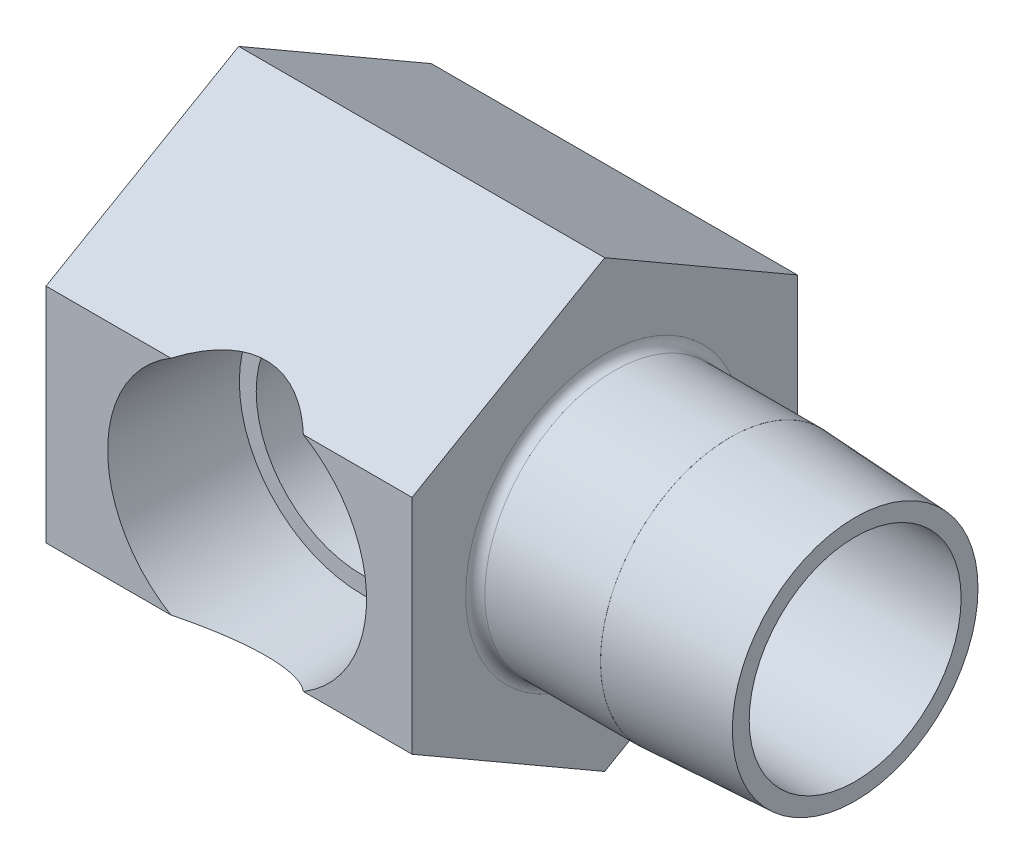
ISO-10303-21;
HEADER;
FILE_DESCRIPTION(('STEP AP214'),'2;1');
FILE_NAME('part.step','',(''),(''),'','','');
FILE_SCHEMA(('AUTOMOTIVE_DESIGN { 1 0 10303 214 1 1 1 1 }'));
ENDSEC;
DATA;
#1=APPLICATION_CONTEXT('core data for automotive mechanical design processes');
#2=APPLICATION_PROTOCOL_DEFINITION('international standard','automotive_design',2000,#1);
#3=PRODUCT_CONTEXT('',#1,'mechanical');
#4=PRODUCT('Part','Part','',(#3));
#5=PRODUCT_RELATED_PRODUCT_CATEGORY('part','',(#4));
#6=PRODUCT_DEFINITION_FORMATION('','',#4);
#7=PRODUCT_DEFINITION_CONTEXT('part definition',#1,'design');
#8=PRODUCT_DEFINITION('design','',#6,#7);
#9=PRODUCT_DEFINITION_SHAPE('','',#8);
#10=(LENGTH_UNIT() NAMED_UNIT(*) SI_UNIT(.MILLI.,.METRE.));
#11=(NAMED_UNIT(*) PLANE_ANGLE_UNIT() SI_UNIT($,.RADIAN.));
#12=(NAMED_UNIT(*) SI_UNIT($,.STERADIAN.) SOLID_ANGLE_UNIT());
#13=UNCERTAINTY_MEASURE_WITH_UNIT(LENGTH_MEASURE(1.E-05),#10,'distance_accuracy_value','');
#14=(GEOMETRIC_REPRESENTATION_CONTEXT(3) GLOBAL_UNCERTAINTY_ASSIGNED_CONTEXT((#13)) GLOBAL_UNIT_ASSIGNED_CONTEXT((#10,
#11,#12)) REPRESENTATION_CONTEXT('',''));
#15=CARTESIAN_POINT('',(0.,0.,0.));
#16=DIRECTION('',(0.,0.,1.));
#17=DIRECTION('',(1.,0.,0.));
#18=AXIS2_PLACEMENT_3D('',#15,#16,#17);
#19=CARTESIAN_POINT('',(10.3124,0.,0.));
#20=DIRECTION('',(-1.,0.,0.));
#21=DIRECTION('',(0.,0.,1.));
#22=AXIS2_PLACEMENT_3D('',#19,#20,#21);
#23=PLANE('',#22);
#24=CARTESIAN_POINT('',(10.3124,0.,0.));
#25=DIRECTION('',(-1.,0.,0.));
#26=DIRECTION('',(0.,0.,1.));
#27=AXIS2_PLACEMENT_3D('',#24,#25,#26);
#28=CIRCLE('',#27,8.73124999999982);
#29=CARTESIAN_POINT('',(10.3124,0.,8.73124999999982));
#30=VERTEX_POINT('',#29);
#31=EDGE_CURVE('E198',#30,#30,#28,.F.);
#32=ORIENTED_EDGE('',*,*,#31,.F.);
#33=EDGE_LOOP('',(#32));
#34=FACE_BOUND('',#33,.T.);
#35=CARTESIAN_POINT('',(10.3124,0.,0.));
#36=DIRECTION('',(-1.,0.,0.));
#37=DIRECTION('',(0.,0.,1.));
#38=AXIS2_PLACEMENT_3D('',#35,#36,#37);
#39=CIRCLE('',#38,10.1219);
#40=CARTESIAN_POINT('',(10.3124,0.,10.1219));
#41=VERTEX_POINT('',#40);
#42=EDGE_CURVE('E247',#41,#41,#39,.T.);
#43=ORIENTED_EDGE('',*,*,#42,.F.);
#44=EDGE_LOOP('',(#43));
#45=FACE_BOUND('',#44,.T.);
#46=ADVANCED_FACE('F14',(#34,#45),#23,.F.);
#47=CARTESIAN_POINT('',(23.0124,0.,0.));
#48=DIRECTION('',(-1.,0.,0.));
#49=DIRECTION('',(0.,0.,1.));
#50=AXIS2_PLACEMENT_3D('',#47,#48,#49);
#51=CYLINDRICAL_SURFACE('',#50,10.668);
#52=CARTESIAN_POINT('',(-9.5377,0.,0.));
#53=DIRECTION('',(1.,0.,0.));
#54=DIRECTION('',(0.,1.,0.));
#55=AXIS2_PLACEMENT_3D('',#52,#53,#54);
#56=CIRCLE('',#55,10.668);
#57=CARTESIAN_POINT('',(-9.5377,10.668,0.));
#58=VERTEX_POINT('',#57);
#59=EDGE_CURVE('E189',#58,#58,#56,.T.);
#60=ORIENTED_EDGE('',*,*,#59,.T.);
#61=EDGE_LOOP('',(#60));
#62=FACE_BOUND('',#61,.T.);
#63=CARTESIAN_POINT('',(0.,0.,0.));
#64=DIRECTION('',(1.,0.,0.));
#65=DIRECTION('',(0.,0.,-1.));
#66=AXIS2_PLACEMENT_3D('',#63,#64,#65);
#67=CIRCLE('',#66,10.668);
#68=CARTESIAN_POINT('',(0.,0.,-10.668));
#69=VERTEX_POINT('',#68);
#70=EDGE_CURVE('E17',#69,#69,#67,.F.);
#71=ORIENTED_EDGE('',*,*,#70,.T.);
#72=EDGE_LOOP('',(#71));
#73=FACE_BOUND('',#72,.T.);
#74=ADVANCED_FACE('F233',(#62,#73),#51,.T.);
#75=CARTESIAN_POINT('',(-10.3251,18.3308710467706,0.));
#76=DIRECTION('',(0.,-0.866025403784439,-0.5));
#77=DIRECTION('',(0.,0.5,-0.866025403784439));
#78=AXIS2_PLACEMENT_3D('',#75,#76,#77);
#79=PLANE('',#78);
#80=CARTESIAN_POINT('',(-24.7396,-1.05255916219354,33.5730859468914));
#81=DIRECTION('',(0.,-0.866025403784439,-0.5));
#82=DIRECTION('',(0.,-0.5,0.866025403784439));
#83=AXIS2_PLACEMENT_3D('',#80,#81,#82);
#84=ELLIPSE('',#83,23.191034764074,11.5476466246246);
#85=CARTESIAN_POINT('',(-19.2805693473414,9.16543552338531,15.875));
#86=VERTEX_POINT('',#85);
#87=CARTESIAN_POINT('',(-30.1986306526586,9.16543552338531,15.875));
#88=VERTEX_POINT('',#87);
#89=EDGE_CURVE('E133',#86,#88,#84,.F.);
#90=ORIENTED_EDGE('',*,*,#89,.F.);
#91=DIRECTION('',(-1.,0.,0.));
#92=VECTOR('',#91,1.);
#93=CARTESIAN_POINT('',(-10.3251,9.16543552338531,15.875));
#94=LINE('',#93,#92);
#95=CARTESIAN_POINT('',(-10.3251,9.16543552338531,15.875));
#96=VERTEX_POINT('',#95);
#97=EDGE_CURVE('E177',#96,#86,#94,.T.);
#98=ORIENTED_EDGE('',*,*,#97,.F.);
#99=DIRECTION('',(0.,-0.5,0.866025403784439));
#100=VECTOR('',#99,1.);
#101=CARTESIAN_POINT('',(-10.3251,18.3308710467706,0.));
#102=LINE('',#101,#100);
#103=CARTESIAN_POINT('',(-10.3251,18.3308710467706,0.));
#104=VERTEX_POINT('',#103);
#105=EDGE_CURVE('E161',#104,#96,#102,.T.);
#106=ORIENTED_EDGE('',*,*,#105,.F.);
#107=DIRECTION('',(-1.,0.,0.));
#108=VECTOR('',#107,1.);
#109=CARTESIAN_POINT('',(-10.3251,18.3308710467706,0.));
#110=LINE('',#109,#108);
#111=CARTESIAN_POINT('',(-40.4876,18.3308710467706,0.));
#112=VERTEX_POINT('',#111);
#113=EDGE_CURVE('E180',#104,#112,#110,.T.);
#114=ORIENTED_EDGE('',*,*,#113,.T.);
#115=DIRECTION('',(0.,-0.5,0.866025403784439));
#116=VECTOR('',#115,1.);
#117=CARTESIAN_POINT('',(-40.4876,18.3308710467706,0.));
#118=LINE('',#117,#116);
#119=CARTESIAN_POINT('',(-40.4876,9.16543552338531,15.875));
#120=VERTEX_POINT('',#119);
#121=EDGE_CURVE('E142',#112,#120,#118,.T.);
#122=ORIENTED_EDGE('',*,*,#121,.T.);
#123=EDGE_CURVE('E176',#88,#120,#94,.T.);
#124=ORIENTED_EDGE('',*,*,#123,.F.);
#125=EDGE_LOOP('',(#90,#98,#106,#114,#122,#124));
#126=FACE_BOUND('',#125,.T.);
#127=ADVANCED_FACE('F239',(#126),#79,.F.);
#128=CARTESIAN_POINT('',(-10.3251,9.16543552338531,15.875));
#129=DIRECTION('',(0.,0.,-1.));
#130=DIRECTION('',(-1.,0.,0.));
#131=AXIS2_PLACEMENT_3D('',#128,#129,#130);
#132=PLANE('',#131);
#133=CARTESIAN_POINT('',(-24.7396,0.,15.875));
#134=DIRECTION('',(0.,0.,-1.));
#135=DIRECTION('',(-1.,0.,0.));
#136=AXIS2_PLACEMENT_3D('',#133,#134,#135);
#137=CIRCLE('',#136,10.668);
#138=CARTESIAN_POINT('',(-19.2805693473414,-9.1654355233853,15.875));
#139=VERTEX_POINT('',#138);
#140=EDGE_CURVE('E131',#86,#139,#137,.T.);
#141=ORIENTED_EDGE('',*,*,#140,.T.);
#142=DIRECTION('',(-1.,0.,0.));
#143=VECTOR('',#142,1.);
#144=CARTESIAN_POINT('',(-10.3251,-9.1654355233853,15.875));
#145=LINE('',#144,#143);
#146=CARTESIAN_POINT('',(-10.3251,-9.1654355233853,15.875));
#147=VERTEX_POINT('',#146);
#148=EDGE_CURVE('E173',#147,#139,#145,.T.);
#149=ORIENTED_EDGE('',*,*,#148,.F.);
#150=DIRECTION('',(0.,-1.,0.));
#151=VECTOR('',#150,1.);
#152=CARTESIAN_POINT('',(-10.3251,9.16543552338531,15.875));
#153=LINE('',#152,#151);
#154=EDGE_CURVE('E163',#96,#147,#153,.T.);
#155=ORIENTED_EDGE('',*,*,#154,.F.);
#156=ORIENTED_EDGE('',*,*,#97,.T.);
#157=EDGE_LOOP('',(#141,#149,#155,#156));
#158=FACE_BOUND('',#157,.T.);
#159=ADVANCED_FACE('F284',(#158),#132,.F.);
#160=CARTESIAN_POINT('',(-30.1986306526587,-9.1654355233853,15.875));
#161=VERTEX_POINT('',#160);
#162=EDGE_CURVE('E37',#161,#88,#137,.T.);
#163=ORIENTED_EDGE('',*,*,#162,.T.);
#164=ORIENTED_EDGE('',*,*,#123,.T.);
#165=DIRECTION('',(0.,-1.,0.));
#166=VECTOR('',#165,1.);
#167=CARTESIAN_POINT('',(-40.4876,9.16543552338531,15.875));
#168=LINE('',#167,#166);
#169=CARTESIAN_POINT('',(-40.4876,-9.1654355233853,15.875));
#170=VERTEX_POINT('',#169);
#171=EDGE_CURVE('E146',#120,#170,#168,.T.);
#172=ORIENTED_EDGE('',*,*,#171,.T.);
#173=EDGE_CURVE('E172',#161,#170,#145,.T.);
#174=ORIENTED_EDGE('',*,*,#173,.F.);
#175=EDGE_LOOP('',(#163,#164,#172,#174));
#176=FACE_BOUND('',#175,.T.);
#177=ADVANCED_FACE('F279',(#176),#132,.F.);
#178=CARTESIAN_POINT('',(-10.3251,-9.1654355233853,15.875));
#179=DIRECTION('',(0.,0.866025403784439,-0.5));
#180=DIRECTION('',(0.,0.5,0.866025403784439));
#181=AXIS2_PLACEMENT_3D('',#178,#179,#180);
#182=PLANE('',#181);
#183=CARTESIAN_POINT('',(-24.7396,1.05255916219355,33.5730859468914));
#184=DIRECTION('',(0.,0.866025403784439,-0.5));
#185=DIRECTION('',(0.,0.5,0.866025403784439));
#186=AXIS2_PLACEMENT_3D('',#183,#184,#185);
#187=ELLIPSE('',#186,23.191034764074,11.5476466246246);
#188=EDGE_CURVE('E22',#161,#139,#187,.F.);
#189=ORIENTED_EDGE('',*,*,#188,.F.);
#190=ORIENTED_EDGE('',*,*,#173,.T.);
#191=DIRECTION('',(0.,-0.5,-0.866025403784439));
#192=VECTOR('',#191,1.);
#193=CARTESIAN_POINT('',(-40.4876,-9.1654355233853,15.875));
#194=LINE('',#193,#192);
#195=CARTESIAN_POINT('',(-40.4876,-18.3308710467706,0.));
#196=VERTEX_POINT('',#195);
#197=EDGE_CURVE('E150',#170,#196,#194,.T.);
#198=ORIENTED_EDGE('',*,*,#197,.T.);
#199=DIRECTION('',(-1.,0.,0.));
#200=VECTOR('',#199,1.);
#201=CARTESIAN_POINT('',(-10.3251,-18.3308710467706,0.));
#202=LINE('',#201,#200);
#203=CARTESIAN_POINT('',(-10.3251,-18.3308710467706,0.));
#204=VERTEX_POINT('',#203);
#205=EDGE_CURVE('E167',#204,#196,#202,.T.);
#206=ORIENTED_EDGE('',*,*,#205,.F.);
#207=DIRECTION('',(0.,-0.5,-0.866025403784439));
#208=VECTOR('',#207,1.);
#209=CARTESIAN_POINT('',(-10.3251,-9.1654355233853,15.875));
#210=LINE('',#209,#208);
#211=EDGE_CURVE('E165',#147,#204,#210,.T.);
#212=ORIENTED_EDGE('',*,*,#211,.F.);
#213=ORIENTED_EDGE('',*,*,#148,.T.);
#214=EDGE_LOOP('',(#189,#190,#198,#206,#212,#213));
#215=FACE_BOUND('',#214,.T.);
#216=ADVANCED_FACE('F283',(#215),#182,.F.);
#217=CARTESIAN_POINT('',(-10.3251,-18.3308710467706,0.));
#218=DIRECTION('',(0.,0.866025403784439,0.5));
#219=DIRECTION('',(0.,-0.5,0.866025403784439));
#220=AXIS2_PLACEMENT_3D('',#217,#218,#219);
#221=PLANE('',#220);
#222=DIRECTION('',(0.,0.5,-0.866025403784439));
#223=VECTOR('',#222,1.);
#224=CARTESIAN_POINT('',(-40.4876,-18.3308710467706,0.));
#225=LINE('',#224,#223);
#226=CARTESIAN_POINT('',(-40.4876,-9.16543552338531,-15.875));
#227=VERTEX_POINT('',#226);
#228=EDGE_CURVE('E135',#196,#227,#225,.T.);
#229=ORIENTED_EDGE('',*,*,#228,.T.);
#230=DIRECTION('',(-1.,0.,0.));
#231=VECTOR('',#230,1.);
#232=CARTESIAN_POINT('',(-10.3251,-9.16543552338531,-15.875));
#233=LINE('',#232,#231);
#234=CARTESIAN_POINT('',(-10.3251,-9.16543552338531,-15.875));
#235=VERTEX_POINT('',#234);
#236=EDGE_CURVE('E186',#235,#227,#233,.T.);
#237=ORIENTED_EDGE('',*,*,#236,.F.);
#238=DIRECTION('',(0.,0.5,-0.866025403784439));
#239=VECTOR('',#238,1.);
#240=CARTESIAN_POINT('',(-10.3251,-18.3308710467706,0.));
#241=LINE('',#240,#239);
#242=EDGE_CURVE('E153',#204,#235,#241,.T.);
#243=ORIENTED_EDGE('',*,*,#242,.F.);
#244=ORIENTED_EDGE('',*,*,#205,.T.);
#245=EDGE_LOOP('',(#229,#237,#243,#244));
#246=FACE_BOUND('',#245,.T.);
#247=ADVANCED_FACE('F303',(#246),#221,.F.);
#248=CARTESIAN_POINT('',(-10.3251,-9.16543552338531,-15.875));
#249=DIRECTION('',(0.,0.,1.));
#250=DIRECTION('',(0.,-1.,0.));
#251=AXIS2_PLACEMENT_3D('',#248,#249,#250);
#252=PLANE('',#251);
#253=DIRECTION('',(0.,1.,0.));
#254=VECTOR('',#253,1.);
#255=CARTESIAN_POINT('',(-40.4876,-9.16543552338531,-15.875));
#256=LINE('',#255,#254);
#257=CARTESIAN_POINT('',(-40.4876,9.16543552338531,-15.875));
#258=VERTEX_POINT('',#257);
#259=EDGE_CURVE('E136',#227,#258,#256,.T.);
#260=ORIENTED_EDGE('',*,*,#259,.T.);
#261=DIRECTION('',(-1.,0.,0.));
#262=VECTOR('',#261,1.);
#263=CARTESIAN_POINT('',(-10.3251,9.16543552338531,-15.875));
#264=LINE('',#263,#262);
#265=CARTESIAN_POINT('',(-10.3251,9.16543552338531,-15.875));
#266=VERTEX_POINT('',#265);
#267=EDGE_CURVE('E183',#266,#258,#264,.T.);
#268=ORIENTED_EDGE('',*,*,#267,.F.);
#269=DIRECTION('',(0.,1.,0.));
#270=VECTOR('',#269,1.);
#271=CARTESIAN_POINT('',(-10.3251,-9.16543552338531,-15.875));
#272=LINE('',#271,#270);
#273=EDGE_CURVE('E157',#235,#266,#272,.T.);
#274=ORIENTED_EDGE('',*,*,#273,.F.);
#275=ORIENTED_EDGE('',*,*,#236,.T.);
#276=EDGE_LOOP('',(#260,#268,#274,#275));
#277=FACE_BOUND('',#276,.T.);
#278=ADVANCED_FACE('F312',(#277),#252,.F.);
#279=CARTESIAN_POINT('',(-10.3251,9.16543552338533,-15.875));
#280=DIRECTION('',(0.,-0.86602540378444,0.5));
#281=DIRECTION('',(0.,-0.5,-0.86602540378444));
#282=AXIS2_PLACEMENT_3D('',#279,#280,#281);
#283=PLANE('',#282);
#284=DIRECTION('',(0.,0.5,0.86602540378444));
#285=VECTOR('',#284,1.);
#286=CARTESIAN_POINT('',(-40.4876,9.16543552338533,-15.875));
#287=LINE('',#286,#285);
#288=EDGE_CURVE('E139',#258,#112,#287,.T.);
#289=ORIENTED_EDGE('',*,*,#288,.T.);
#290=ORIENTED_EDGE('',*,*,#113,.F.);
#291=DIRECTION('',(0.,0.5,0.86602540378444));
#292=VECTOR('',#291,1.);
#293=CARTESIAN_POINT('',(-10.3251,9.16543552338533,-15.875));
#294=LINE('',#293,#292);
#295=EDGE_CURVE('E159',#266,#104,#294,.T.);
#296=ORIENTED_EDGE('',*,*,#295,.F.);
#297=ORIENTED_EDGE('',*,*,#267,.T.);
#298=EDGE_LOOP('',(#289,#290,#296,#297));
#299=FACE_BOUND('',#298,.T.);
#300=ADVANCED_FACE('F323',(#299),#283,.F.);
#301=CARTESIAN_POINT('',(-10.3251,-9.16543552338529,-15.875));
#302=DIRECTION('',(1.,0.,0.));
#303=DIRECTION('',(0.,1.,0.));
#304=AXIS2_PLACEMENT_3D('',#301,#302,#303);
#305=PLANE('',#304);
#306=CARTESIAN_POINT('',(-10.3251,0.,0.));
#307=DIRECTION('',(1.,0.,0.));
#308=DIRECTION('',(0.,1.,0.));
#309=AXIS2_PLACEMENT_3D('',#306,#307,#308);
#310=CIRCLE('',#309,11.4554);
#311=CARTESIAN_POINT('',(-10.3251,11.4554,0.));
#312=VERTEX_POINT('',#311);
#313=EDGE_CURVE('E192',#312,#312,#310,.F.);
#314=ORIENTED_EDGE('',*,*,#313,.T.);
#315=EDGE_LOOP('',(#314));
#316=FACE_BOUND('',#315,.T.);
#317=ORIENTED_EDGE('',*,*,#242,.T.);
#318=ORIENTED_EDGE('',*,*,#273,.T.);
#319=ORIENTED_EDGE('',*,*,#295,.T.);
#320=ORIENTED_EDGE('',*,*,#105,.T.);
#321=ORIENTED_EDGE('',*,*,#154,.T.);
#322=ORIENTED_EDGE('',*,*,#211,.T.);
#323=EDGE_LOOP('',(#317,#318,#319,#320,#321,#322));
#324=FACE_BOUND('',#323,.T.);
#325=ADVANCED_FACE('F332',(#316,#324),#305,.T.);
#326=CARTESIAN_POINT('',(-40.4876,-9.16543552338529,-15.875));
#327=DIRECTION('',(1.,0.,0.));
#328=DIRECTION('',(0.,1.,0.));
#329=AXIS2_PLACEMENT_3D('',#326,#327,#328);
#330=PLANE('',#329);
#331=ORIENTED_EDGE('',*,*,#228,.F.);
#332=ORIENTED_EDGE('',*,*,#197,.F.);
#333=ORIENTED_EDGE('',*,*,#171,.F.);
#334=ORIENTED_EDGE('',*,*,#121,.F.);
#335=ORIENTED_EDGE('',*,*,#288,.F.);
#336=ORIENTED_EDGE('',*,*,#259,.F.);
#337=EDGE_LOOP('',(#331,#332,#333,#334,#335,#336));
#338=FACE_BOUND('',#337,.T.);
#339=ADVANCED_FACE('F340',(#338),#330,.F.);
#340=CARTESIAN_POINT('',(-9.5377,0.,0.));
#341=DIRECTION('',(1.,0.,0.));
#342=DIRECTION('',(0.,1.,0.));
#343=AXIS2_PLACEMENT_3D('',#340,#341,#342);
#344=TOROIDAL_SURFACE('',#343,11.4554,0.7874);
#345=ORIENTED_EDGE('',*,*,#313,.F.);
#346=EDGE_LOOP('',(#345));
#347=FACE_BOUND('',#346,.T.);
#348=ORIENTED_EDGE('',*,*,#59,.F.);
#349=EDGE_LOOP('',(#348));
#350=FACE_BOUND('',#349,.T.);
#351=ADVANCED_FACE('F230',(#347,#350),#344,.F.);
#352=CARTESIAN_POINT('',(-24.7396,0.,15.875));
#353=DIRECTION('',(0.,0.,1.));
#354=DIRECTION('',(1.,0.,0.));
#355=AXIS2_PLACEMENT_3D('',#352,#353,#354);
#356=CONICAL_SURFACE('',#355,10.668,0.0523598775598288);
#357=CARTESIAN_POINT('',(-17.1717321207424,-6.73011387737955,5.5624));
#358=CARTESIAN_POINT('',(-17.0275717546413,-6.58213571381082,5.74139140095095));
#359=CARTESIAN_POINT('',(-16.8852115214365,-6.42627781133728,5.9154706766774));
#360=CARTESIAN_POINT('',(-16.6058645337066,-6.09837401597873,6.2530133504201));
#361=CARTESIAN_POINT('',(-16.4688864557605,-5.92630339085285,6.41645986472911));
#362=CARTESIAN_POINT('',(-16.2013558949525,-5.56440643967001,6.73277955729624));
#363=CARTESIAN_POINT('',(-16.0708711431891,-5.37443622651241,6.8855461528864));
#364=CARTESIAN_POINT('',(-15.8198832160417,-4.97815123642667,7.17727145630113));
#365=CARTESIAN_POINT('',(-15.6993738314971,-4.77184678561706,7.31623876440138));
#366=CARTESIAN_POINT('',(-15.4954339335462,-4.38969848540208,7.55009803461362));
#367=CARTESIAN_POINT('',(-15.4096327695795,-4.21696245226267,7.64800966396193));
#368=CARTESIAN_POINT('',(-15.2467159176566,-3.86199712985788,7.83324733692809));
#369=CARTESIAN_POINT('',(-15.1695981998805,-3.67977007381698,7.92057585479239));
#370=CARTESIAN_POINT('',(-15.0254329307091,-3.30686520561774,8.08335597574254));
#371=CARTESIAN_POINT('',(-14.958359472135,-3.11621083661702,8.15883815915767));
#372=CARTESIAN_POINT('',(-14.8352696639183,-2.72696762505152,8.29704746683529));
#373=CARTESIAN_POINT('',(-14.7792476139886,-2.52838293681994,8.3597811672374));
#374=CARTESIAN_POINT('',(-14.678850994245,-2.12236093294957,8.47201885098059));
#375=CARTESIAN_POINT('',(-14.6345976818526,-1.91485526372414,8.52138519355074));
#376=CARTESIAN_POINT('',(-14.5594905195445,-1.49442789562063,8.6050766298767));
#377=CARTESIAN_POINT('',(-14.5286368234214,-1.2815061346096,8.63940155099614));
#378=CARTESIAN_POINT('',(-14.4810952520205,-0.852126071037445,8.6922608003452));
#379=CARTESIAN_POINT('',(-14.4644079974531,-0.635667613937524,8.71079443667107));
#380=CARTESIAN_POINT('',(-14.4456434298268,-0.201352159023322,8.73163383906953));
#381=CARTESIAN_POINT('',(-14.4435641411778,0.0165046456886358,8.73394179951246));
#382=CARTESIAN_POINT('',(-14.4533416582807,0.421689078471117,8.72308449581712));
#383=CARTESIAN_POINT('',(-14.4633341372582,0.60912306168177,8.71198920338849));
#384=CARTESIAN_POINT('',(-14.4940403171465,0.982016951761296,8.67786932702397));
#385=CARTESIAN_POINT('',(-14.5147539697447,1.16747686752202,8.65484479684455));
#386=CARTESIAN_POINT('',(-14.5664900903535,1.53498981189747,8.5972733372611));
#387=CARTESIAN_POINT('',(-14.5975051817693,1.71704518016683,8.562734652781));
#388=CARTESIAN_POINT('',(-14.6692899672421,2.07675633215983,8.48267459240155));
#389=CARTESIAN_POINT('',(-14.7100600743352,2.25441192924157,8.43715275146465));
#390=CARTESIAN_POINT('',(-14.8007844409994,2.6047674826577,8.33566102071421));
#391=CARTESIAN_POINT('',(-14.8507593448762,2.77745527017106,8.27966764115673));
#392=CARTESIAN_POINT('',(-14.9590733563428,3.11671661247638,8.15802210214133));
#393=CARTESIAN_POINT('',(-15.0174154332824,3.28328797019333,8.09236651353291));
#394=CARTESIAN_POINT('',(-15.2041078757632,3.77365322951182,7.88167923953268));
#395=CARTESIAN_POINT('',(-15.3439507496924,4.08744436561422,7.72312033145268));
#396=CARTESIAN_POINT('',(-15.6140346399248,4.61896069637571,7.41435317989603));
#397=CARTESIAN_POINT('',(-15.7395970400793,4.84261456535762,7.27000880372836));
#398=CARTESIAN_POINT('',(-16.0025998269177,5.27158893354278,6.96522192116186));
#399=CARTESIAN_POINT('',(-16.14005173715,5.47689124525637,6.80476377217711));
#400=CARTESIAN_POINT('',(-16.4231511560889,5.86754844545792,6.47087544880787));
#401=CARTESIAN_POINT('',(-16.568740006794,6.05302358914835,6.29753573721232));
#402=CARTESIAN_POINT('',(-16.7918419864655,6.31733501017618,6.02841371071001));
#403=CARTESIAN_POINT('',(-16.8669232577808,6.40304815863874,5.93727721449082));
#404=CARTESIAN_POINT('',(-17.0184060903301,6.56995442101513,5.75203886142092));
#405=CARTESIAN_POINT('',(-17.0948074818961,6.65114811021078,5.65793738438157));
#406=CARTESIAN_POINT('',(-17.1717321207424,6.73011387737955,5.5624));
#407=B_SPLINE_CURVE_WITH_KNOTS('',3,(#357,#358,#359,#360,#361,#362,#363,#364,#365,#366,#367,
#368,#369,#370,#371,#372,#373,#374,#375,#376,#377,#378,#379,#380,#381,#382,#383,#384,#385,#386,
#387,#388,#389,#390,#391,#392,#393,#394,#395,#396,#397,#398,#399,#400,#401,#402,#403,#404,#405,
#406),.UNSPECIFIED.,.F.,.F.,(4,2,2,2,2,2,2,2,2,2,2,2,2,2,2,2,2,2,2,2,2,2,2,2,4),(0.,
0.820023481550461,1.64131879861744,2.46989520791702,3.29795193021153,3.94627694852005,
4.59445010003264,5.24092150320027,5.8870585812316,6.53961554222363,7.19217999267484,
7.84477303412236,8.49727781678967,9.06067705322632,9.6240737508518,10.187067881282,
10.7500858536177,11.3143822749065,11.8788794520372,13.0099648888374,13.8917191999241,
14.7743379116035,15.65125682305,16.0888974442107,16.5264822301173),.UNSPECIFIED.);
#408=CARTESIAN_POINT('',(-17.1715710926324,-6.72994857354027,5.5626));
#409=VERTEX_POINT('',#408);
#410=CARTESIAN_POINT('',(-17.1715710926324,6.72994857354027,5.5626));
#411=VERTEX_POINT('',#410);
#412=EDGE_CURVE('E116',#409,#411,#407,.T.);
#413=ORIENTED_EDGE('',*,*,#412,.F.);
#414=CARTESIAN_POINT('',(-24.7396,0.,5.5626));
#415=DIRECTION('',(0.,0.,-1.));
#416=DIRECTION('',(-1.,0.,0.));
#417=AXIS2_PLACEMENT_3D('',#414,#415,#416);
#418=CIRCLE('',#417,10.1275500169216);
#419=EDGE_CURVE('E118',#409,#411,#418,.T.);
#420=ORIENTED_EDGE('',*,*,#419,.T.);
#421=EDGE_LOOP('',(#413,#420));
#422=FACE_BOUND('',#421,.T.);
#423=ORIENTED_EDGE('',*,*,#89,.T.);
#424=ORIENTED_EDGE('',*,*,#162,.F.);
#425=ORIENTED_EDGE('',*,*,#188,.T.);
#426=ORIENTED_EDGE('',*,*,#140,.F.);
#427=EDGE_LOOP('',(#423,#424,#425,#426));
#428=FACE_BOUND('',#427,.T.);
#429=ADVANCED_FACE('F221',(#422,#428),#356,.F.);
#430=CARTESIAN_POINT('',(-14.6120499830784,0.,5.5626));
#431=DIRECTION('',(0.,0.,1.));
#432=DIRECTION('',(1.,0.,0.));
#433=AXIS2_PLACEMENT_3D('',#430,#431,#432);
#434=PLANE('',#433);
#435=DIRECTION('',(1.,0.,0.));
#436=VECTOR('',#435,1.);
#437=CARTESIAN_POINT('',(46.3279901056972,-6.72994857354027,5.5626));
#438=LINE('',#437,#436);
#439=CARTESIAN_POINT('',(-19.1670381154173,-6.72994857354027,5.5626));
#440=VERTEX_POINT('',#439);
#441=EDGE_CURVE('E120',#440,#409,#438,.T.);
#442=ORIENTED_EDGE('',*,*,#441,.F.);
#443=CARTESIAN_POINT('',(-24.7396,0.,5.5626));
#444=DIRECTION('',(0.,0.,-1.));
#445=DIRECTION('',(-1.,0.,0.));
#446=AXIS2_PLACEMENT_3D('',#443,#444,#445);
#447=CIRCLE('',#446,8.7376);
#448=CARTESIAN_POINT('',(-19.1670381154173,6.72994857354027,5.5626));
#449=VERTEX_POINT('',#448);
#450=EDGE_CURVE('E111',#440,#449,#447,.T.);
#451=ORIENTED_EDGE('',*,*,#450,.T.);
#452=DIRECTION('',(1.,0.,0.));
#453=VECTOR('',#452,1.);
#454=CARTESIAN_POINT('',(46.3279901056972,6.72994857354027,5.5626));
#455=LINE('',#454,#453);
#456=EDGE_CURVE('E112',#411,#449,#455,.F.);
#457=ORIENTED_EDGE('',*,*,#456,.F.);
#458=ORIENTED_EDGE('',*,*,#419,.F.);
#459=EDGE_LOOP('',(#442,#451,#457,#458));
#460=FACE_BOUND('',#459,.T.);
#461=ADVANCED_FACE('F222',(#460),#434,.T.);
#462=CARTESIAN_POINT('',(-24.7396,0.,27.2225954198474));
#463=DIRECTION('',(0.,0.,-1.));
#464=DIRECTION('',(-1.,0.,0.));
#465=AXIS2_PLACEMENT_3D('',#462,#463,#464);
#466=CYLINDRICAL_SURFACE('',#465,8.7376);
#467=CARTESIAN_POINT('',(-16.002,0.,-8.73124999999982));
#468=CARTESIAN_POINT('',(-16.0020020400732,-0.194584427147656,-8.73124795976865));
#469=CARTESIAN_POINT('',(-16.0085144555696,-0.389211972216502,-8.72473081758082));
#470=CARTESIAN_POINT('',(-16.0344312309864,-0.776828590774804,-8.69879510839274));
#471=CARTESIAN_POINT('',(-16.0538433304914,-0.969816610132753,-8.67936879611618));
#472=CARTESIAN_POINT('',(-16.1051919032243,-1.35279132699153,-8.62798220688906));
#473=CARTESIAN_POINT('',(-16.1371515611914,-1.54277178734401,-8.59599872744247));
#474=CARTESIAN_POINT('',(-16.2129602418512,-1.91800162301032,-8.5201326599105));
#475=CARTESIAN_POINT('',(-16.256815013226,-2.10324866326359,-8.47624431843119));
#476=CARTESIAN_POINT('',(-16.3552007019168,-2.46629304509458,-8.37778181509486));
#477=CARTESIAN_POINT('',(-16.4096455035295,-2.64413729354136,-8.32329384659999));
#478=CARTESIAN_POINT('',(-16.5285521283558,-2.99304779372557,-8.2042906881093));
#479=CARTESIAN_POINT('',(-16.5930177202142,-3.16411146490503,-8.13977172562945));
#480=CARTESIAN_POINT('',(-16.7309899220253,-3.49864884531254,-8.00168209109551));
#481=CARTESIAN_POINT('',(-16.8044923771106,-3.66212599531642,-7.92811557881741));
#482=CARTESIAN_POINT('',(-16.9596542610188,-3.98115293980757,-7.77281411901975));
#483=CARTESIAN_POINT('',(-17.0413155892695,-4.13670087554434,-7.69107726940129));
#484=CARTESIAN_POINT('',(-17.2468436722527,-4.50158308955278,-7.48535222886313));
#485=CARTESIAN_POINT('',(-17.3743057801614,-4.7068770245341,-7.35776254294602));
#486=CARTESIAN_POINT('',(-17.64142348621,-5.10080513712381,-7.09036110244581));
#487=CARTESIAN_POINT('',(-17.7810802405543,-5.28943773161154,-6.95054818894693));
#488=CARTESIAN_POINT('',(-18.0709842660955,-5.65057111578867,-6.66029722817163));
#489=CARTESIAN_POINT('',(-18.2212555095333,-5.82303320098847,-6.50983512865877));
#490=CARTESIAN_POINT('',(-18.5304028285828,-6.15161912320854,-6.20026353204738));
#491=CARTESIAN_POINT('',(-18.6892789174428,-6.30774293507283,-6.04115402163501));
#492=CARTESIAN_POINT('',(-19.077133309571,-6.66146937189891,-5.65267776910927));
#493=CARTESIAN_POINT('',(-19.3094480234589,-6.85174414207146,-5.41994958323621));
#494=CARTESIAN_POINT('',(-19.7848472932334,-7.20301910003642,-4.94356992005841));
#495=CARTESIAN_POINT('',(-20.0279369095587,-7.36400534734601,-4.69991330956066));
#496=CARTESIAN_POINT('',(-20.5220085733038,-7.65767994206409,-4.20446075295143));
#497=CARTESIAN_POINT('',(-20.7729811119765,-7.79040098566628,-3.95267460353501));
#498=CARTESIAN_POINT('',(-21.2809025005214,-8.0288054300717,-3.44270332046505));
#499=CARTESIAN_POINT('',(-21.5378485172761,-8.13450137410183,-3.18452121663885));
#500=CARTESIAN_POINT('',(-21.951750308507,-8.28254836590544,-2.76793783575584));
#501=CARTESIAN_POINT('',(-22.1073855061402,-8.3332845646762,-2.61114099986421));
#502=CARTESIAN_POINT('',(-22.4197776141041,-8.42559206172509,-2.29589073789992));
#503=CARTESIAN_POINT('',(-22.5765347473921,-8.46716148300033,-2.13743697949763));
#504=CARTESIAN_POINT('',(-22.8566044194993,-8.53322740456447,-1.85341979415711));
#505=CARTESIAN_POINT('',(-22.9798151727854,-8.5594718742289,-1.72815748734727));
#506=CARTESIAN_POINT('',(-23.2257977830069,-8.60637337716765,-1.47694205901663));
#507=CARTESIAN_POINT('',(-23.3485697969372,-8.62704779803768,-1.35099236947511));
#508=CARTESIAN_POINT('',(-23.5518174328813,-8.65687758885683,-1.1403356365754));
#509=CARTESIAN_POINT('',(-23.6325518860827,-8.66756378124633,-1.05608985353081));
#510=CARTESIAN_POINT('',(-23.7938983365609,-8.68665280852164,-0.885577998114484));
#511=CARTESIAN_POINT('',(-23.8745009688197,-8.6950316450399,-0.799300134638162));
#512=CARTESIAN_POINT('',(-23.9939135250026,-8.70581636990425,-0.667427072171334));
#513=CARTESIAN_POINT('',(-24.033702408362,-8.70912835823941,-0.622785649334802));
#514=CARTESIAN_POINT('',(-24.1122485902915,-8.71513811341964,-0.532136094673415));
#515=CARTESIAN_POINT('',(-24.150999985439,-8.71783283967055,-0.486122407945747));
#516=CARTESIAN_POINT('',(-24.2252154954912,-8.72252382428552,-0.393005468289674));
#517=CARTESIAN_POINT('',(-24.2607284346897,-8.72453249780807,-0.345940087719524));
#518=CARTESIAN_POINT('',(-24.3260105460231,-8.72786360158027,-0.248009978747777));
#519=CARTESIAN_POINT('',(-24.3558375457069,-8.72919320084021,-0.197191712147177));
#520=CARTESIAN_POINT('',(-24.381573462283,-8.73026315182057,-0.131726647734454));
#521=CARTESIAN_POINT('',(-24.3855934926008,-8.73042652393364,-0.120449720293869));
#522=CARTESIAN_POINT('',(-24.3927089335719,-8.73071197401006,-0.097606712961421));
#523=CARTESIAN_POINT('',(-24.3958040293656,-8.73083403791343,-0.0860405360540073));
#524=CARTESIAN_POINT('',(-24.4033826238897,-8.7311305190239,-0.0511699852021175));
#525=CARTESIAN_POINT('',(-24.4062538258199,-8.7312389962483,-0.0274712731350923));
#526=CARTESIAN_POINT('',(-24.406791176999,-8.73125946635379,0.0201415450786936));
#527=CARTESIAN_POINT('',(-24.4044222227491,-8.73117013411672,0.0440560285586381));
#528=CARTESIAN_POINT('',(-24.3950886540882,-8.73080677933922,0.0911053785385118));
#529=CARTESIAN_POINT('',(-24.3880850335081,-8.73053118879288,0.114231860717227));
#530=CARTESIAN_POINT('',(-24.3613715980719,-8.72942751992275,0.184805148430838));
#531=CARTESIAN_POINT('',(-24.336262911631,-8.7283274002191,0.230059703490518));
#532=CARTESIAN_POINT('',(-24.2808399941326,-8.72559491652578,0.317207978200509));
#533=CARTESIAN_POINT('',(-24.2504888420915,-8.72395869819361,0.359074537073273));
#534=CARTESIAN_POINT('',(-24.1481965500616,-8.71784635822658,0.49241666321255));
#535=CARTESIAN_POINT('',(-24.0717549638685,-8.71237926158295,0.580385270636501));
#536=CARTESIAN_POINT('',(-23.9162306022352,-8.69907947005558,0.75378513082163));
#537=CARTESIAN_POINT('',(-23.8371433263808,-8.69124254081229,0.839211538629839));
#538=CARTESIAN_POINT('',(-23.6779684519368,-8.67323190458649,1.00847172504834));
#539=CARTESIAN_POINT('',(-23.5978843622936,-8.66306494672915,1.09230936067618));
#540=CARTESIAN_POINT('',(-23.4373250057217,-8.64038918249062,1.25915432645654));
#541=CARTESIAN_POINT('',(-23.3568500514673,-8.62788201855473,1.34216219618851));
#542=CARTESIAN_POINT('',(-23.1168171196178,-8.58710464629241,1.58869321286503));
#543=CARTESIAN_POINT('',(-22.9570155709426,-8.5553951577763,1.75143229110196));
#544=CARTESIAN_POINT('',(-22.6379021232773,-8.48264950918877,2.07530786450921));
#545=CARTESIAN_POINT('',(-22.4785902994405,-8.44161198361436,2.23644412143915));
#546=CARTESIAN_POINT('',(-22.0019471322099,-8.30423407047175,2.71769566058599));
#547=CARTESIAN_POINT('',(-21.6861412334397,-8.1936672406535,3.03541666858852));
#548=CARTESIAN_POINT('',(-21.0620025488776,-7.93318916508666,3.6625986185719));
#549=CARTESIAN_POINT('',(-20.7536771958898,-7.78324040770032,3.97205137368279));
#550=CARTESIAN_POINT('',(-20.1484858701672,-7.44229907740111,4.57908034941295));
#551=CARTESIAN_POINT('',(-19.8516106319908,-7.25134054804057,4.87666617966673));
#552=CARTESIAN_POINT('',(-19.3875780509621,-6.910044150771,5.34165989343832));
#553=CARTESIAN_POINT('',(-19.2154110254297,-6.7733595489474,5.51414839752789));
#554=CARTESIAN_POINT('',(-18.8780954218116,-6.48366113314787,5.85204308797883));
#555=CARTESIAN_POINT('',(-18.7129463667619,-6.33064843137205,6.01744975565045));
#556=CARTESIAN_POINT('',(-18.2305672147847,-5.84682072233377,6.50052935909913));
#557=CARTESIAN_POINT('',(-17.9255519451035,-5.49060305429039,6.80591666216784));
#558=CARTESIAN_POINT('',(-17.417683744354,-4.78392446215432,7.31434488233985));
#559=CARTESIAN_POINT('',(-17.2064743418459,-4.44561570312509,7.52576393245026));
#560=CARTESIAN_POINT('',(-16.9207757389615,-3.90553017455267,7.8117285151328));
#561=CARTESIAN_POINT('',(-16.8307332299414,-3.72007663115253,7.90185159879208));
#562=CARTESIAN_POINT('',(-16.6623661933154,-3.33876204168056,8.07036499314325));
#563=CARTESIAN_POINT('',(-16.5840394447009,-3.14290297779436,8.14875752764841));
#564=CARTESIAN_POINT('',(-16.4533259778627,-2.77741093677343,8.27957822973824));
#565=CARTESIAN_POINT('',(-16.3988030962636,-2.60930304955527,8.33414480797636));
#566=CARTESIAN_POINT('',(-16.2994595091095,-2.26745357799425,8.43356675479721));
#567=CARTESIAN_POINT('',(-16.254636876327,-2.0937131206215,8.4784240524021));
#568=CARTESIAN_POINT('',(-16.1754298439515,-1.74160557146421,8.55769160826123));
#569=CARTESIAN_POINT('',(-16.1410407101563,-1.5632406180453,8.59210660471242));
#570=CARTESIAN_POINT('',(-16.0832828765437,-1.20295803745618,8.6499075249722));
#571=CARTESIAN_POINT('',(-16.059914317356,-1.02104036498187,8.67329330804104));
#572=CARTESIAN_POINT('',(-16.024576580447,-0.654283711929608,8.70865698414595));
#573=CARTESIAN_POINT('',(-16.0126513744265,-0.46943621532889,8.72059087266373));
#574=CARTESIAN_POINT('',(-16.0005951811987,-0.0989697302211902,8.73265584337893));
#575=CARTESIAN_POINT('',(-16.0004642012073,0.0866492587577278,8.7327869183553));
#576=CARTESIAN_POINT('',(-16.0119990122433,0.457153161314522,8.72124371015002));
#577=CARTESIAN_POINT('',(-16.0236651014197,0.642038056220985,8.70956912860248));
#578=CARTESIAN_POINT('',(-16.0585609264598,1.00960102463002,8.67464769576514));
#579=CARTESIAN_POINT('',(-16.0817904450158,1.19227913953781,8.65140106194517));
#580=CARTESIAN_POINT('',(-16.1376962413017,1.5435978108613,8.59545357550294));
#581=CARTESIAN_POINT('',(-16.1697477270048,1.71243875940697,8.56337800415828));
#582=CARTESIAN_POINT('',(-16.2432172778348,2.04605005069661,8.48985242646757));
#583=CARTESIAN_POINT('',(-16.2846388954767,2.21081882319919,8.44839886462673));
#584=CARTESIAN_POINT('',(-16.3762362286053,2.53539687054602,8.35672960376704));
#585=CARTESIAN_POINT('',(-16.4264119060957,2.69520616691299,8.3065139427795));
#586=CARTESIAN_POINT('',(-16.5348605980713,3.0092382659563,8.19797696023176));
#587=CARTESIAN_POINT('',(-16.5931352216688,3.16345995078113,8.13965402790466));
#588=CARTESIAN_POINT('',(-16.7397423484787,3.52103226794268,7.99292233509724));
#589=CARTESIAN_POINT('',(-16.8312810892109,3.72176242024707,7.90130357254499));
#590=CARTESIAN_POINT('',(-17.0264734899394,4.11105686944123,7.70593347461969));
#591=CARTESIAN_POINT('',(-17.1301306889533,4.2996175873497,7.6021785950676));
#592=CARTESIAN_POINT('',(-17.3480971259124,4.66439092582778,7.38399695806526));
#593=CARTESIAN_POINT('',(-17.4624211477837,4.84058579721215,7.26955538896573));
#594=CARTESIAN_POINT('',(-17.7001339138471,5.18020722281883,7.03158489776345));
#595=CARTESIAN_POINT('',(-17.8235230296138,5.34363325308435,6.90805560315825));
#596=CARTESIAN_POINT('',(-18.1251066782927,5.71583582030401,6.60610841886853));
#597=CARTESIAN_POINT('',(-18.3067164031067,5.91907945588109,6.42426373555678));
#598=CARTESIAN_POINT('',(-18.6817462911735,6.30238103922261,6.0486994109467));
#599=CARTESIAN_POINT('',(-18.8751707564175,6.48243046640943,5.85497544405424));
#600=CARTESIAN_POINT('',(-19.2718799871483,6.8203891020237,5.45757943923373));
#601=CARTESIAN_POINT('',(-19.4751828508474,6.97825543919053,5.25388913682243));
#602=CARTESIAN_POINT('',(-19.8893619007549,7.27223101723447,4.83880832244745));
#603=CARTESIAN_POINT('',(-20.1002376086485,7.40834162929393,4.6274182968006));
#604=CARTESIAN_POINT('',(-20.602950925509,7.70363293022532,4.12327947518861));
#605=CARTESIAN_POINT('',(-20.89729486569,7.85421669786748,3.82794844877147));
#606=CARTESIAN_POINT('',(-21.3445677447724,8.05270383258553,3.37868435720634));
#607=CARTESIAN_POINT('',(-21.4946883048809,8.11432340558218,3.22781450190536));
#608=CARTESIAN_POINT('',(-21.7964934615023,8.2285969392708,2.92424701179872));
#609=CARTESIAN_POINT('',(-21.9481779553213,8.28125148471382,2.77154949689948));
#610=CARTESIAN_POINT('',(-22.2523738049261,8.37763466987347,2.46490144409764));
#611=CARTESIAN_POINT('',(-22.4048825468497,8.42138304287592,2.31095447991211));
#612=CARTESIAN_POINT('',(-22.7106688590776,8.5002358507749,2.00155294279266));
#613=CARTESIAN_POINT('',(-22.8639465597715,8.53533876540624,1.84609810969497));
#614=CARTESIAN_POINT('',(-23.1703819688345,8.59695458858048,1.53375849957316));
#615=CARTESIAN_POINT('',(-23.323539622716,8.62347694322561,1.37687549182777));
#616=CARTESIAN_POINT('',(-23.6286430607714,8.66804695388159,1.060768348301));
#617=CARTESIAN_POINT('',(-23.7805894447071,8.68609909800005,0.901545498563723));
#618=CARTESIAN_POINT('',(-24.02409592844,8.70877341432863,0.634873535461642));
#619=CARTESIAN_POINT('',(-24.1176991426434,8.71589085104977,0.529425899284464));
#620=CARTESIAN_POINT('',(-24.2552735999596,8.72430499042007,0.35410855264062));
#621=CARTESIAN_POINT('',(-24.3034456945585,8.72679002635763,0.288138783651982));
#622=CARTESIAN_POINT('',(-24.3541031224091,8.729101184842,0.194881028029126));
#623=CARTESIAN_POINT('',(-24.3650948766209,8.72957575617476,0.172518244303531));
#624=CARTESIAN_POINT('',(-24.3839468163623,8.73036364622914,0.126517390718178));
#625=CARTESIAN_POINT('',(-24.3918167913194,8.73067746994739,0.102883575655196));
#626=CARTESIAN_POINT('',(-24.4017747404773,8.73106804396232,0.05952342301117));
#627=CARTESIAN_POINT('',(-24.4047237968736,8.73118048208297,0.0400042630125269));
#628=CARTESIAN_POINT('',(-24.4071151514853,8.73127193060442,0.000763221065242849));
#629=CARTESIAN_POINT('',(-24.4065621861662,8.73125112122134,-0.018958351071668));
#630=CARTESIAN_POINT('',(-24.402103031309,8.73107971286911,-0.0579056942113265));
#631=CARTESIAN_POINT('',(-24.3982115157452,8.7309296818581,-0.077133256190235));
#632=CARTESIAN_POINT('',(-24.3877566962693,8.73051484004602,-0.114860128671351));
#633=CARTESIAN_POINT('',(-24.3811873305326,8.73024976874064,-0.133357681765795));
#634=CARTESIAN_POINT('',(-24.3511300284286,8.72898749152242,-0.206233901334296));
#635=CARTESIAN_POINT('',(-24.320324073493,8.72759479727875,-0.257405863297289));
#636=CARTESIAN_POINT('',(-24.2532518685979,8.72412321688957,-0.356144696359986));
#637=CARTESIAN_POINT('',(-24.2169308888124,8.72203717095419,-0.40366729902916));
#638=CARTESIAN_POINT('',(-24.0932190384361,8.71408023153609,-0.557845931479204));
#639=CARTESIAN_POINT('',(-24.0010810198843,8.70682435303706,-0.660674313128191));
#640=CARTESIAN_POINT('',(-23.8144213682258,8.68900060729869,-0.863851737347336));
#641=CARTESIAN_POINT('',(-23.7198961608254,8.67842746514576,-0.964196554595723));
#642=CARTESIAN_POINT('',(-23.5302099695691,8.65402061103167,-1.16304341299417));
#643=CARTESIAN_POINT('',(-23.4350541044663,8.64020255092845,-1.2615519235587));
#644=CARTESIAN_POINT('',(-23.2445085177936,8.60927992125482,-1.45768707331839));
#645=CARTESIAN_POINT('',(-23.1491189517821,8.59217714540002,-1.55531416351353));
#646=CARTESIAN_POINT('',(-22.7416135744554,8.51203730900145,-1.97110883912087));
#647=CARTESIAN_POINT('',(-22.4295012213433,8.43292269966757,-2.28638870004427));
#648=CARTESIAN_POINT('',(-21.8099951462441,8.23825366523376,-2.91080137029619));
#649=CARTESIAN_POINT('',(-21.5026058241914,8.1226671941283,-3.21992851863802));
#650=CARTESIAN_POINT('',(-20.8952779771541,7.85348929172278,-3.82998854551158));
#651=CARTESIAN_POINT('',(-20.5953517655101,7.69983911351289,-4.13090795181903));
#652=CARTESIAN_POINT('',(-20.0071166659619,7.35294307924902,-4.72079553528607));
#653=CARTESIAN_POINT('',(-19.7187988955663,7.15972821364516,-5.00977285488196));
#654=CARTESIAN_POINT('',(-19.2669219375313,6.81483228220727,-5.46254493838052));
#655=CARTESIAN_POINT('',(-19.0984059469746,6.67617271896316,-5.63136167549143));
#656=CARTESIAN_POINT('',(-18.7685104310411,6.38282740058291,-5.96180105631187));
#657=CARTESIAN_POINT('',(-18.6071304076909,6.22814276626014,-6.12342420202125));
#658=CARTESIAN_POINT('',(-18.1362689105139,5.73984762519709,-6.59494764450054));
#659=CARTESIAN_POINT('',(-17.8391751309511,5.38133142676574,-6.8923944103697));
#660=CARTESIAN_POINT('',(-17.346107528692,4.67228730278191,-7.38599386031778));
#661=CARTESIAN_POINT('',(-17.1416907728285,4.33363653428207,-7.5906099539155));
#662=CARTESIAN_POINT('',(-16.86614207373,3.79409663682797,-7.86641137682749));
#663=CARTESIAN_POINT('',(-16.7794608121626,3.60895802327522,-7.95316917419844));
#664=CARTESIAN_POINT('',(-16.6177879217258,3.2286920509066,-8.11498092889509));
#665=CARTESIAN_POINT('',(-16.5427937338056,3.03356689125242,-8.19003744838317));
#666=CARTESIAN_POINT('',(-16.4178808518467,2.66926471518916,-8.31505186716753));
#667=CARTESIAN_POINT('',(-16.3658705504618,2.50151910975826,-8.36710351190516));
#668=CARTESIAN_POINT('',(-16.2715206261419,2.16067893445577,-8.46152731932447));
#669=CARTESIAN_POINT('',(-16.2291790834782,1.98758543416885,-8.50390140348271));
#670=CARTESIAN_POINT('',(-16.1549250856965,1.63737162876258,-8.57821183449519));
#671=CARTESIAN_POINT('',(-16.1229905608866,1.46026070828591,-8.61017026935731));
#672=CARTESIAN_POINT('',(-16.0700022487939,1.10287331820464,-8.66319796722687));
#673=CARTESIAN_POINT('',(-16.0489430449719,0.922598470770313,-8.6842726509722));
#674=CARTESIAN_POINT('',(-16.0230379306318,0.61842168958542,-8.71019674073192));
#675=CARTESIAN_POINT('',(-16.015156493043,0.495022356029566,-8.71808392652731));
#676=CARTESIAN_POINT('',(-16.00463637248,0.247754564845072,-8.72861171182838));
#677=CARTESIAN_POINT('',(-16.0019987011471,0.123886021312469,-8.73125129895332));
#678=CARTESIAN_POINT('',(-16.002,0.,-8.73124999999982));
#679=B_SPLINE_CURVE_WITH_KNOTS('',3,(#467,#468,#469,#470,#471,#472,#473,#474,#475,#476,#477,
#478,#479,#480,#481,#482,#483,#484,#485,#486,#487,#488,#489,#490,#491,#492,#493,#494,#495,#496,
#497,#498,#499,#500,#501,#502,#503,#504,#505,#506,#507,#508,#509,#510,#511,#512,#513,#514,#515,
#516,#517,#518,#519,#520,#521,#522,#523,#524,#525,#526,#527,#528,#529,#530,#531,#532,#533,#534,
#535,#536,#537,#538,#539,#540,#541,#542,#543,#544,#545,#546,#547,#548,#549,#550,#551,#552,#553,
#554,#555,#556,#557,#558,#559,#560,#561,#562,#563,#564,#565,#566,#567,#568,#569,#570,#571,#572,
#573,#574,#575,#576,#577,#578,#579,#580,#581,#582,#583,#584,#585,#586,#587,#588,#589,#590,#591,
#592,#593,#594,#595,#596,#597,#598,#599,#600,#601,#602,#603,#604,#605,#606,#607,#608,#609,#610,
#611,#612,#613,#614,#615,#616,#617,#618,#619,#620,#621,#622,#623,#624,#625,#626,#627,#628,#629,
#630,#631,#632,#633,#634,#635,#636,#637,#638,#639,#640,#641,#642,#643,#644,#645,#646,#647,#648,
#649,#650,#651,#652,#653,#654,#655,#656,#657,#658,#659,#660,#661,#662,#663,#664,#665,#666,#667,
#668,#669,#670,#671,#672,#673,#674,#675,#676,#677,#678),.UNSPECIFIED.,.T.,.F.,(4,2,2,2,2,2,2,2,
2,2,2,2,2,2,2,2,2,2,2,2,2,2,2,2,2,2,2,2,2,2,2,2,2,2,2,2,2,2,2,2,2,2,2,2,2,2,2,2,2,2,2,2,2,2,2,2,
2,2,2,2,2,2,2,2,2,2,2,2,2,2,2,2,2,2,2,2,2,2,2,2,2,2,2,2,2,2,2,2,2,2,2,2,2,2,2,2,2,2,2,2,2,2,2,2,
2,4),(0.,0.583612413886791,1.16757530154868,1.75262232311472,2.3379525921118,2.91870833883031,
3.49968302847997,4.08039159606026,4.66123567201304,5.47979311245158,6.29842824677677,
7.11897529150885,7.93952359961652,9.07759978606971,10.2162162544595,11.3535083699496,
12.4902716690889,13.1701291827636,13.85012577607,14.3830023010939,14.9141955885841,
15.2656970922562,15.62072714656,15.8004033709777,15.9809464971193,16.1580238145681,
16.3331909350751,16.3690696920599,16.4049606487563,16.4760278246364,16.5475725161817,
16.61972713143,16.7737867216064,16.9289791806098,17.2784485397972,17.6285460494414,
17.9776420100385,18.3264938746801,19.0170858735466,19.7077790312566,21.0901665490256,
22.4738756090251,23.856440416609,24.6940964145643,25.5316953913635,27.2028655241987,
28.5515700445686,29.225841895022,29.8999857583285,30.4543223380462,31.0085486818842,
31.5625231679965,32.1165047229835,32.67260655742,33.2287087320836,33.7848249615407,
34.3409307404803,34.8648402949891,35.3889488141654,35.9130550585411,36.4372655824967,
37.1528654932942,37.8686749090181,38.5854915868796,39.3023376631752,40.2838426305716,
41.2657071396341,42.2494438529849,43.2331185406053,44.5610507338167,45.2256261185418,
45.8901581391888,46.5532013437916,47.2163610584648,47.8787882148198,48.5408639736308,
48.9645425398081,49.208361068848,49.2829836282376,49.3573702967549,49.4163167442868,
49.4751834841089,49.5337928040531,49.5925355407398,49.7702540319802,49.9498678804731,
50.3640564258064,50.7789069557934,51.1917961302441,51.6044604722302,52.9547097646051,
54.3061487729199,55.6596867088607,57.012168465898,57.8392729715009,58.6663196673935,
60.3161744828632,61.6467920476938,62.3123085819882,62.9776791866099,63.5266629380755,
64.0755375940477,64.6232405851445,65.1706705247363,65.5421672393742,65.9137356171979),.UNSPECIFIED.);
#680=CARTESIAN_POINT('',(-17.077014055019,-4.1988606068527,-7.65534428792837));
#681=VERTEX_POINT('',#680);
#682=EDGE_CURVE('E101',#681,#440,#679,.T.);
#683=ORIENTED_EDGE('',*,*,#682,.F.);
#684=CARTESIAN_POINT('',(-24.7396,0.,-7.65534428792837));
#685=DIRECTION('',(0.,0.,-1.));
#686=DIRECTION('',(-1.,0.,0.));
#687=AXIS2_PLACEMENT_3D('',#684,#685,#686);
#688=CIRCLE('',#687,8.7376);
#689=CARTESIAN_POINT('',(-17.077014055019,4.19886060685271,-7.65534428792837));
#690=VERTEX_POINT('',#689);
#691=EDGE_CURVE('E109',#681,#690,#688,.T.);
#692=ORIENTED_EDGE('',*,*,#691,.T.);
#693=EDGE_CURVE('E29',#449,#690,#679,.T.);
#694=ORIENTED_EDGE('',*,*,#693,.F.);
#695=ORIENTED_EDGE('',*,*,#450,.F.);
#696=EDGE_LOOP('',(#683,#692,#694,#695));
#697=FACE_BOUND('',#696,.T.);
#698=ADVANCED_FACE('F108',(#697),#466,.F.);
#699=CARTESIAN_POINT('',(-24.7396,0.,-7.65534428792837));
#700=DIRECTION('',(0.,0.,1.));
#701=DIRECTION('',(1.,0.,0.));
#702=AXIS2_PLACEMENT_3D('',#699,#700,#701);
#703=CONICAL_SURFACE('',#702,8.7376,1.0471975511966);
#704=CARTESIAN_POINT('',(-17.0768188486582,4.19922522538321,-7.65514428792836));
#705=CARTESIAN_POINT('',(-17.119680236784,4.11919395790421,-7.69904721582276));
#706=CARTESIAN_POINT('',(-17.1605706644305,4.03767589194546,-7.74212840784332));
#707=CARTESIAN_POINT('',(-17.2383795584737,3.8718198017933,-7.82639060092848));
#708=CARTESIAN_POINT('',(-17.2752982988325,3.78748197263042,-7.86757173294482));
#709=CARTESIAN_POINT('',(-17.3799085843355,3.53082485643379,-7.9877145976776));
#710=CARTESIAN_POINT('',(-17.4416407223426,3.35451271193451,-8.06346884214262));
#711=CARTESIAN_POINT('',(-17.5494175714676,2.9949771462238,-8.20376471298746));
#712=CARTESIAN_POINT('',(-17.5956026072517,2.81183308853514,-8.26840391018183));
#713=CARTESIAN_POINT('',(-17.6748833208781,2.43901153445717,-8.38595098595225));
#714=CARTESIAN_POINT('',(-17.7079734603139,2.24933131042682,-8.43885389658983));
#715=CARTESIAN_POINT('',(-17.7650103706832,1.85315874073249,-8.53490938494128));
#716=CARTESIAN_POINT('',(-17.7882429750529,1.64636373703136,-8.57722933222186));
#717=CARTESIAN_POINT('',(-17.8249154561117,1.22942523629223,-8.6468452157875));
#718=CARTESIAN_POINT('',(-17.8383545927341,1.01928148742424,-8.67414001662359));
#719=CARTESIAN_POINT('',(-17.8573278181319,0.596327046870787,-8.71346235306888));
#720=CARTESIAN_POINT('',(-17.8628280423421,0.383508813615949,-8.72542446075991));
#721=CARTESIAN_POINT('',(-17.8666789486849,-0.042481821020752,-8.73374524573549));
#722=CARTESIAN_POINT('',(-17.8650300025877,-0.255654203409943,-8.73010473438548));
#723=CARTESIAN_POINT('',(-17.8542616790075,-0.68327243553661,-8.70713496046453));
#724=CARTESIAN_POINT('',(-17.8450622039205,-0.897707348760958,-8.68763750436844));
#725=CARTESIAN_POINT('',(-17.8176771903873,-1.3240495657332,-8.63294858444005));
#726=CARTESIAN_POINT('',(-17.7994902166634,-1.53595646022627,-8.59775461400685));
#727=CARTESIAN_POINT('',(-17.7519118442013,-1.95439228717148,-8.512370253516));
#728=CARTESIAN_POINT('',(-17.722575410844,-2.16094237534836,-8.46225368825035));
#729=CARTESIAN_POINT('',(-17.6499203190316,-2.56751673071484,-8.34787958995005));
#730=CARTESIAN_POINT('',(-17.6066112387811,-2.76754536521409,-8.28363175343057));
#731=CARTESIAN_POINT('',(-17.5262552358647,-3.07251528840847,-8.17361317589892));
#732=CARTESIAN_POINT('',(-17.4948483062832,-3.18054225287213,-8.13216368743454));
#733=CARTESIAN_POINT('',(-17.4265932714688,-3.39337844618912,-8.04567525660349));
#734=CARTESIAN_POINT('',(-17.3897463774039,-3.49818838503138,-8.00063711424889));
#735=CARTESIAN_POINT('',(-17.3102255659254,-3.70471548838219,-7.9071308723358));
#736=CARTESIAN_POINT('',(-17.2675231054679,-3.80641431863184,-7.85864656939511));
#737=CARTESIAN_POINT('',(-17.1764314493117,-4.00587016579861,-7.75887940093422));
#738=CARTESIAN_POINT('',(-17.1280401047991,-4.10362567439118,-7.70759548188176));
#739=CARTESIAN_POINT('',(-17.0768188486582,-4.19922522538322,-7.65514428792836));
#740=B_SPLINE_CURVE_WITH_KNOTS('',3,(#704,#705,#706,#707,#708,#709,#710,#711,#712,#713,#714,
#715,#716,#717,#718,#719,#720,#721,#722,#723,#724,#725,#726,#727,#728,#729,#730,#731,#732,#733,
#734,#735,#736,#737,#738,#739),.UNSPECIFIED.,.F.,.F.,(4,2,2,2,2,2,2,2,2,2,2,2,2,2,2,2,2,4),(0.,
0.302467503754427,0.604914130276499,1.20849247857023,1.8064670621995,2.40469428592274,
3.04091498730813,3.67718376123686,4.31615869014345,4.9551003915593,5.60090908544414,
6.24682094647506,6.88958900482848,7.53191738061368,7.89140548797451,8.25081367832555,
8.61204058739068,8.97340438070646),.UNSPECIFIED.);
#741=EDGE_CURVE('E9',#690,#681,#740,.T.);
#742=ORIENTED_EDGE('',*,*,#741,.F.);
#743=ORIENTED_EDGE('',*,*,#691,.F.);
#744=EDGE_LOOP('',(#742,#743));
#745=FACE_BOUND('',#744,.T.);
#746=CARTESIAN_POINT('',(-24.7396,0.,-12.6999999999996));
#747=VERTEX_POINT('',#746);
#748=VERTEX_LOOP('',#747);
#749=FACE_BOUND('',#748,.T.);
#750=ADVANCED_FACE('F114',(#745,#749),#703,.F.);
#751=CARTESIAN_POINT('',(46.3279901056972,0.,0.));
#752=DIRECTION('',(1.,0.,0.));
#753=DIRECTION('',(0.,0.,-1.));
#754=AXIS2_PLACEMENT_3D('',#751,#752,#753);
#755=CYLINDRICAL_SURFACE('',#754,8.73124999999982);
#756=ORIENTED_EDGE('',*,*,#412,.T.);
#757=ORIENTED_EDGE('',*,*,#456,.T.);
#758=ORIENTED_EDGE('',*,*,#693,.T.);
#759=ORIENTED_EDGE('',*,*,#741,.T.);
#760=ORIENTED_EDGE('',*,*,#682,.T.);
#761=ORIENTED_EDGE('',*,*,#441,.T.);
#762=EDGE_LOOP('',(#756,#757,#758,#759,#760,#761));
#763=FACE_BOUND('',#762,.T.);
#764=ORIENTED_EDGE('',*,*,#31,.T.);
#765=EDGE_LOOP('',(#764));
#766=FACE_BOUND('',#765,.T.);
#767=ADVANCED_FACE('F99',(#763,#766),#755,.F.);
#768=CARTESIAN_POINT('',(0.,0.,-10.6623499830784));
#769=DIRECTION('',(1.,0.,0.));
#770=DIRECTION('',(0.,0.,-1.));
#771=AXIS2_PLACEMENT_3D('',#768,#769,#770);
#772=PLANE('',#771);
#773=ORIENTED_EDGE('',*,*,#70,.F.);
#774=EDGE_LOOP('',(#773));
#775=FACE_BOUND('',#774,.T.);
#776=CARTESIAN_POINT('',(0.,0.,0.));
#777=DIRECTION('',(-1.,0.,0.));
#778=DIRECTION('',(0.,0.,1.));
#779=AXIS2_PLACEMENT_3D('',#776,#777,#778);
#780=CIRCLE('',#779,10.6623499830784);
#781=CARTESIAN_POINT('',(0.,0.,10.6623499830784));
#782=VERTEX_POINT('',#781);
#783=EDGE_CURVE('E214',#782,#782,#780,.T.);
#784=ORIENTED_EDGE('',*,*,#783,.T.);
#785=EDGE_LOOP('',(#784));
#786=FACE_BOUND('',#785,.T.);
#787=ADVANCED_FACE('F204',(#775,#786),#772,.T.);
#788=CARTESIAN_POINT('',(0.,0.,0.));
#789=DIRECTION('',(-1.,0.,0.));
#790=DIRECTION('',(0.,0.,1.));
#791=AXIS2_PLACEMENT_3D('',#788,#789,#790);
#792=CONICAL_SURFACE('',#791,10.6623499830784,0.0523598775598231);
#793=ORIENTED_EDGE('',*,*,#42,.T.);
#794=EDGE_LOOP('',(#793));
#795=FACE_BOUND('',#794,.T.);
#796=ORIENTED_EDGE('',*,*,#783,.F.);
#797=EDGE_LOOP('',(#796));
#798=FACE_BOUND('',#797,.T.);
#799=ADVANCED_FACE('F257',(#795,#798),#792,.T.);
#800=CLOSED_SHELL('',(#46,#74,#127,#159,#177,#216,#247,#278,#300,#325,#339,#351,#429,#461,#698,
#750,#767,#787,#799));
#801=MANIFOLD_SOLID_BREP('B1',#800);
#802=ADVANCED_BREP_SHAPE_REPRESENTATION('',(#18,#801),#14);
#803=SHAPE_DEFINITION_REPRESENTATION(#9,#802);
ENDSEC;
END-ISO-10303-21;
